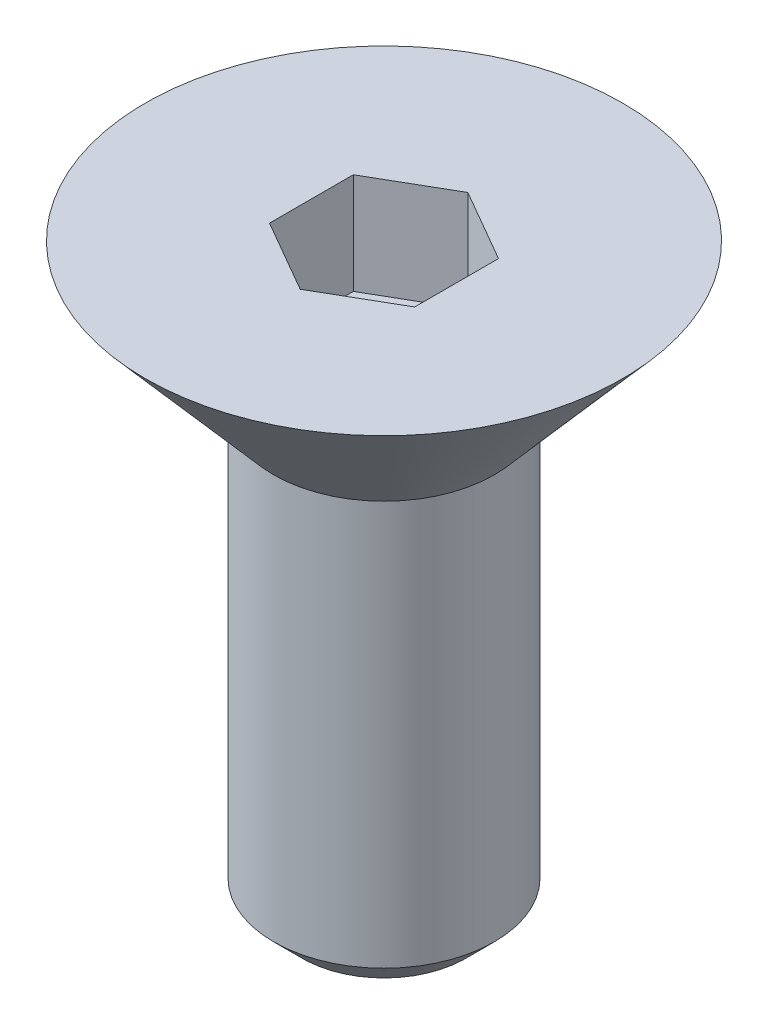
from build123d import *

# Parameters (mm, degrees)
CUT_EXTRUDE1_DEPTH = 2.2098


with BuildPart() as part:
    # Sketch1 → Base-Revolve (revolve)
    with BuildSketch(Plane.XY, mode=Mode.PRIVATE) as base_revolve_sk:
        Polygon((0, 0), (2.413, 0), (5.2197, 3.2258), (0, 3.2258), align=None)
    revolve(base_revolve_sk.sketch.rotate(Axis((0, 0, 0), (0, 1, 0)), 90), axis=Axis((0, 0, 0), (0, 1, 0)))

    # Sketch2 → Boss-Revolve1 (revolve)
    with BuildSketch(Plane.XY, mode=Mode.PRIVATE) as boss_revolve1_sk:
        Polygon((0, -9.4742), (1.78308, -9.4742), (2.413, -8.84428), (2.413, 0), (0, 0), align=None)
    revolve(boss_revolve1_sk.sketch.rotate(Axis((0, 0, 0), (0, 1, 0)), 90), axis=Axis((0, 0, 0), (0, 1, 0)))

    # Sketch3 → Cut-Extrude1 (cut)
    with BuildSketch(Plane(origin=(0, 3.2258, 0), x_dir=(-1, 0, 0), z_dir=(0, 1, 0))):
        Polygon((1.5875, 0.916543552), (0, 1.833087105), (-1.5875, 0.916543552), (-1.5875, -0.916543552), (0, -1.833087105), (1.5875, -0.916543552), align=None)
    extrude(amount=-CUT_EXTRUDE1_DEPTH, mode=Mode.SUBTRACT)


solid = part.part
